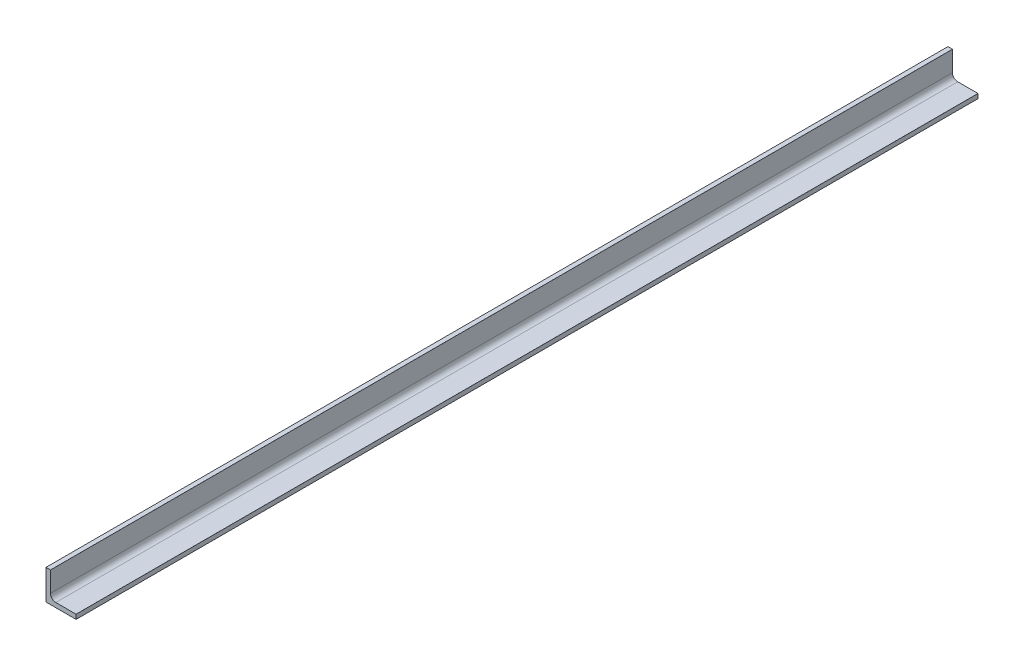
ISO-10303-21;
HEADER;
FILE_DESCRIPTION(('STEP AP214'),'2;1');
FILE_NAME('part.step','',(''),(''),'','','');
FILE_SCHEMA(('AUTOMOTIVE_DESIGN { 1 0 10303 214 1 1 1 1 }'));
ENDSEC;
DATA;
#1=APPLICATION_CONTEXT('core data for automotive mechanical design processes');
#2=APPLICATION_PROTOCOL_DEFINITION('international standard','automotive_design',2000,#1);
#3=PRODUCT_CONTEXT('',#1,'mechanical');
#4=PRODUCT('Part','Part','',(#3));
#5=PRODUCT_RELATED_PRODUCT_CATEGORY('part','',(#4));
#6=PRODUCT_DEFINITION_FORMATION('','',#4);
#7=PRODUCT_DEFINITION_CONTEXT('part definition',#1,'design');
#8=PRODUCT_DEFINITION('design','',#6,#7);
#9=PRODUCT_DEFINITION_SHAPE('','',#8);
#10=(LENGTH_UNIT() NAMED_UNIT(*) SI_UNIT(.MILLI.,.METRE.));
#11=(NAMED_UNIT(*) PLANE_ANGLE_UNIT() SI_UNIT($,.RADIAN.));
#12=(NAMED_UNIT(*) SI_UNIT($,.STERADIAN.) SOLID_ANGLE_UNIT());
#13=UNCERTAINTY_MEASURE_WITH_UNIT(LENGTH_MEASURE(1.E-05),#10,'distance_accuracy_value','');
#14=(GEOMETRIC_REPRESENTATION_CONTEXT(3) GLOBAL_UNCERTAINTY_ASSIGNED_CONTEXT((#13)) GLOBAL_UNIT_ASSIGNED_CONTEXT((#10,
#11,#12)) REPRESENTATION_CONTEXT('',''));
#15=CARTESIAN_POINT('',(0.,0.,0.));
#16=DIRECTION('',(0.,0.,1.));
#17=DIRECTION('',(1.,0.,0.));
#18=AXIS2_PLACEMENT_3D('',#15,#16,#17);
#19=CARTESIAN_POINT('',(20.,0.,600.));
#20=DIRECTION('',(0.,1.,0.));
#21=DIRECTION('',(-1.,0.,0.));
#22=AXIS2_PLACEMENT_3D('',#19,#20,#21);
#23=PLANE('',#22);
#24=DIRECTION('',(1.,0.,0.));
#25=VECTOR('',#24,1.);
#26=CARTESIAN_POINT('',(20.,0.,0.));
#27=LINE('',#26,#25);
#28=CARTESIAN_POINT('',(0.,0.,0.));
#29=VERTEX_POINT('',#28);
#30=CARTESIAN_POINT('',(20.,0.,0.));
#31=VERTEX_POINT('',#30);
#32=EDGE_CURVE('E134',#29,#31,#27,.T.);
#33=ORIENTED_EDGE('',*,*,#32,.T.);
#34=DIRECTION('',(0.,0.,-1.));
#35=VECTOR('',#34,1.);
#36=CARTESIAN_POINT('',(20.,0.,600.));
#37=LINE('',#36,#35);
#38=CARTESIAN_POINT('',(20.,0.,600.));
#39=VERTEX_POINT('',#38);
#40=EDGE_CURVE('E11',#39,#31,#37,.T.);
#41=ORIENTED_EDGE('',*,*,#40,.F.);
#42=DIRECTION('',(1.,0.,0.));
#43=VECTOR('',#42,1.);
#44=CARTESIAN_POINT('',(20.,0.,600.));
#45=LINE('',#44,#43);
#46=CARTESIAN_POINT('',(0.,0.,600.));
#47=VERTEX_POINT('',#46);
#48=EDGE_CURVE('E150',#47,#39,#45,.T.);
#49=ORIENTED_EDGE('',*,*,#48,.F.);
#50=DIRECTION('',(0.,0.,-1.));
#51=VECTOR('',#50,1.);
#52=CARTESIAN_POINT('',(0.,0.,600.));
#53=LINE('',#52,#51);
#54=EDGE_CURVE('E130',#47,#29,#53,.T.);
#55=ORIENTED_EDGE('',*,*,#54,.T.);
#56=EDGE_LOOP('',(#33,#41,#49,#55));
#57=FACE_BOUND('',#56,.T.);
#58=ADVANCED_FACE('F32',(#57),#23,.F.);
#59=CARTESIAN_POINT('',(20.,2.99,600.));
#60=DIRECTION('',(-1.,0.,0.));
#61=DIRECTION('',(0.,-1.,0.));
#62=AXIS2_PLACEMENT_3D('',#59,#60,#61);
#63=PLANE('',#62);
#64=DIRECTION('',(0.,1.,0.));
#65=VECTOR('',#64,1.);
#66=CARTESIAN_POINT('',(20.,2.99,0.));
#67=LINE('',#66,#65);
#68=CARTESIAN_POINT('',(20.,2.99,0.));
#69=VERTEX_POINT('',#68);
#70=EDGE_CURVE('E137',#31,#69,#67,.T.);
#71=ORIENTED_EDGE('',*,*,#70,.T.);
#72=DIRECTION('',(0.,0.,-1.));
#73=VECTOR('',#72,1.);
#74=CARTESIAN_POINT('',(20.,2.99,600.));
#75=LINE('',#74,#73);
#76=CARTESIAN_POINT('',(20.,2.99,600.));
#77=VERTEX_POINT('',#76);
#78=EDGE_CURVE('E40',#77,#69,#75,.T.);
#79=ORIENTED_EDGE('',*,*,#78,.F.);
#80=DIRECTION('',(0.,1.,0.));
#81=VECTOR('',#80,1.);
#82=CARTESIAN_POINT('',(20.,2.99,600.));
#83=LINE('',#82,#81);
#84=EDGE_CURVE('E94',#39,#77,#83,.T.);
#85=ORIENTED_EDGE('',*,*,#84,.F.);
#86=ORIENTED_EDGE('',*,*,#40,.T.);
#87=EDGE_LOOP('',(#71,#79,#85,#86));
#88=FACE_BOUND('',#87,.T.);
#89=ADVANCED_FACE('F193',(#88),#63,.F.);
#90=CARTESIAN_POINT('',(19.99,2.99,600.));
#91=DIRECTION('',(0.,0.,-1.));
#92=DIRECTION('',(-1.,0.,0.));
#93=AXIS2_PLACEMENT_3D('',#90,#91,#92);
#94=CYLINDRICAL_SURFACE('',#93,0.00999999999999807);
#95=CARTESIAN_POINT('',(19.99,2.99,0.));
#96=DIRECTION('',(0.,0.,1.));
#97=DIRECTION('',(1.,0.,0.));
#98=AXIS2_PLACEMENT_3D('',#95,#96,#97);
#99=CIRCLE('',#98,0.00999999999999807);
#100=CARTESIAN_POINT('',(19.99,3.,0.));
#101=VERTEX_POINT('',#100);
#102=EDGE_CURVE('E139',#69,#101,#99,.T.);
#103=ORIENTED_EDGE('',*,*,#102,.T.);
#104=DIRECTION('',(0.,0.,-1.));
#105=VECTOR('',#104,1.);
#106=CARTESIAN_POINT('',(19.99,3.,600.));
#107=LINE('',#106,#105);
#108=CARTESIAN_POINT('',(19.99,3.,600.));
#109=VERTEX_POINT('',#108);
#110=EDGE_CURVE('E160',#109,#101,#107,.T.);
#111=ORIENTED_EDGE('',*,*,#110,.F.);
#112=CARTESIAN_POINT('',(19.99,2.99,600.));
#113=DIRECTION('',(0.,0.,1.));
#114=DIRECTION('',(1.,0.,0.));
#115=AXIS2_PLACEMENT_3D('',#112,#113,#114);
#116=CIRCLE('',#115,0.00999999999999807);
#117=EDGE_CURVE('E168',#77,#109,#116,.T.);
#118=ORIENTED_EDGE('',*,*,#117,.F.);
#119=ORIENTED_EDGE('',*,*,#78,.T.);
#120=EDGE_LOOP('',(#103,#111,#118,#119));
#121=FACE_BOUND('',#120,.T.);
#122=ADVANCED_FACE('F166',(#121),#94,.T.);
#123=CARTESIAN_POINT('',(6.5,3.,600.));
#124=DIRECTION('',(0.,-1.,0.));
#125=DIRECTION('',(1.,0.,0.));
#126=AXIS2_PLACEMENT_3D('',#123,#124,#125);
#127=PLANE('',#126);
#128=DIRECTION('',(-1.,0.,0.));
#129=VECTOR('',#128,1.);
#130=CARTESIAN_POINT('',(6.5,3.,0.));
#131=LINE('',#130,#129);
#132=CARTESIAN_POINT('',(6.5,3.,0.));
#133=VERTEX_POINT('',#132);
#134=EDGE_CURVE('E141',#101,#133,#131,.T.);
#135=ORIENTED_EDGE('',*,*,#134,.T.);
#136=DIRECTION('',(0.,0.,-1.));
#137=VECTOR('',#136,1.);
#138=CARTESIAN_POINT('',(6.5,3.,600.));
#139=LINE('',#138,#137);
#140=CARTESIAN_POINT('',(6.5,3.,600.));
#141=VERTEX_POINT('',#140);
#142=EDGE_CURVE('E157',#141,#133,#139,.T.);
#143=ORIENTED_EDGE('',*,*,#142,.F.);
#144=DIRECTION('',(-1.,0.,0.));
#145=VECTOR('',#144,1.);
#146=CARTESIAN_POINT('',(6.5,3.,600.));
#147=LINE('',#146,#145);
#148=EDGE_CURVE('E184',#109,#141,#147,.T.);
#149=ORIENTED_EDGE('',*,*,#148,.F.);
#150=ORIENTED_EDGE('',*,*,#110,.T.);
#151=EDGE_LOOP('',(#135,#143,#149,#150));
#152=FACE_BOUND('',#151,.T.);
#153=ADVANCED_FACE('F177',(#152),#127,.F.);
#154=CARTESIAN_POINT('',(6.5,6.5,600.));
#155=DIRECTION('',(0.,0.,-1.));
#156=DIRECTION('',(-1.,0.,0.));
#157=AXIS2_PLACEMENT_3D('',#154,#155,#156);
#158=CYLINDRICAL_SURFACE('',#157,3.5);
#159=CARTESIAN_POINT('',(6.5,6.5,0.));
#160=DIRECTION('',(0.,0.,-1.));
#161=DIRECTION('',(-1.,0.,0.));
#162=AXIS2_PLACEMENT_3D('',#159,#160,#161);
#163=CIRCLE('',#162,3.5);
#164=CARTESIAN_POINT('',(3.,6.5,0.));
#165=VERTEX_POINT('',#164);
#166=EDGE_CURVE('E143',#133,#165,#163,.T.);
#167=ORIENTED_EDGE('',*,*,#166,.T.);
#168=DIRECTION('',(0.,0.,-1.));
#169=VECTOR('',#168,1.);
#170=CARTESIAN_POINT('',(3.,6.5,600.));
#171=LINE('',#170,#169);
#172=CARTESIAN_POINT('',(3.,6.5,600.));
#173=VERTEX_POINT('',#172);
#174=EDGE_CURVE('E154',#173,#165,#171,.T.);
#175=ORIENTED_EDGE('',*,*,#174,.F.);
#176=CARTESIAN_POINT('',(6.5,6.5,600.));
#177=DIRECTION('',(0.,0.,-1.));
#178=DIRECTION('',(-1.,0.,0.));
#179=AXIS2_PLACEMENT_3D('',#176,#177,#178);
#180=CIRCLE('',#179,3.5);
#181=EDGE_CURVE('E183',#141,#173,#180,.T.);
#182=ORIENTED_EDGE('',*,*,#181,.F.);
#183=ORIENTED_EDGE('',*,*,#142,.T.);
#184=EDGE_LOOP('',(#167,#175,#182,#183));
#185=FACE_BOUND('',#184,.T.);
#186=ADVANCED_FACE('F181',(#185),#158,.F.);
#187=CARTESIAN_POINT('',(3.,19.99,600.));
#188=DIRECTION('',(-1.,0.,0.));
#189=DIRECTION('',(0.,-1.,0.));
#190=AXIS2_PLACEMENT_3D('',#187,#188,#189);
#191=PLANE('',#190);
#192=DIRECTION('',(0.,1.,0.));
#193=VECTOR('',#192,1.);
#194=CARTESIAN_POINT('',(3.,19.99,0.));
#195=LINE('',#194,#193);
#196=CARTESIAN_POINT('',(3.,19.99,0.));
#197=VERTEX_POINT('',#196);
#198=EDGE_CURVE('E145',#165,#197,#195,.T.);
#199=ORIENTED_EDGE('',*,*,#198,.T.);
#200=DIRECTION('',(0.,0.,-1.));
#201=VECTOR('',#200,1.);
#202=CARTESIAN_POINT('',(3.,19.99,600.));
#203=LINE('',#202,#201);
#204=CARTESIAN_POINT('',(3.,19.99,600.));
#205=VERTEX_POINT('',#204);
#206=EDGE_CURVE('E125',#205,#197,#203,.T.);
#207=ORIENTED_EDGE('',*,*,#206,.F.);
#208=DIRECTION('',(0.,1.,0.));
#209=VECTOR('',#208,1.);
#210=CARTESIAN_POINT('',(3.,19.99,600.));
#211=LINE('',#210,#209);
#212=EDGE_CURVE('E116',#173,#205,#211,.T.);
#213=ORIENTED_EDGE('',*,*,#212,.F.);
#214=ORIENTED_EDGE('',*,*,#174,.T.);
#215=EDGE_LOOP('',(#199,#207,#213,#214));
#216=FACE_BOUND('',#215,.T.);
#217=ADVANCED_FACE('F205',(#216),#191,.F.);
#218=CARTESIAN_POINT('',(2.99,19.99,600.));
#219=DIRECTION('',(0.,0.,-1.));
#220=DIRECTION('',(-1.,0.,0.));
#221=AXIS2_PLACEMENT_3D('',#218,#219,#220);
#222=CYLINDRICAL_SURFACE('',#221,0.0100000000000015);
#223=CARTESIAN_POINT('',(2.99,19.99,0.));
#224=DIRECTION('',(0.,0.,1.));
#225=DIRECTION('',(1.,0.,0.));
#226=AXIS2_PLACEMENT_3D('',#223,#224,#225);
#227=CIRCLE('',#226,0.0100000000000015);
#228=CARTESIAN_POINT('',(2.99,20.,0.));
#229=VERTEX_POINT('',#228);
#230=EDGE_CURVE('E124',#197,#229,#227,.T.);
#231=ORIENTED_EDGE('',*,*,#230,.T.);
#232=DIRECTION('',(0.,0.,-1.));
#233=VECTOR('',#232,1.);
#234=CARTESIAN_POINT('',(2.99,20.,600.));
#235=LINE('',#234,#233);
#236=CARTESIAN_POINT('',(2.99,20.,600.));
#237=VERTEX_POINT('',#236);
#238=EDGE_CURVE('E121',#237,#229,#235,.T.);
#239=ORIENTED_EDGE('',*,*,#238,.F.);
#240=CARTESIAN_POINT('',(2.99,19.99,600.));
#241=DIRECTION('',(0.,0.,1.));
#242=DIRECTION('',(1.,0.,0.));
#243=AXIS2_PLACEMENT_3D('',#240,#241,#242);
#244=CIRCLE('',#243,0.0100000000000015);
#245=EDGE_CURVE('E110',#205,#237,#244,.T.);
#246=ORIENTED_EDGE('',*,*,#245,.F.);
#247=ORIENTED_EDGE('',*,*,#206,.T.);
#248=EDGE_LOOP('',(#231,#239,#246,#247));
#249=FACE_BOUND('',#248,.T.);
#250=ADVANCED_FACE('F122',(#249),#222,.T.);
#251=CARTESIAN_POINT('',(0.,20.,600.));
#252=DIRECTION('',(0.,-1.,0.));
#253=DIRECTION('',(1.,0.,0.));
#254=AXIS2_PLACEMENT_3D('',#251,#252,#253);
#255=PLANE('',#254);
#256=DIRECTION('',(-1.,0.,0.));
#257=VECTOR('',#256,1.);
#258=CARTESIAN_POINT('',(0.,20.,0.));
#259=LINE('',#258,#257);
#260=CARTESIAN_POINT('',(0.,20.,0.));
#261=VERTEX_POINT('',#260);
#262=EDGE_CURVE('E80',#229,#261,#259,.T.);
#263=ORIENTED_EDGE('',*,*,#262,.T.);
#264=DIRECTION('',(0.,0.,-1.));
#265=VECTOR('',#264,1.);
#266=CARTESIAN_POINT('',(0.,20.,600.));
#267=LINE('',#266,#265);
#268=CARTESIAN_POINT('',(0.,20.,600.));
#269=VERTEX_POINT('',#268);
#270=EDGE_CURVE('E126',#269,#261,#267,.T.);
#271=ORIENTED_EDGE('',*,*,#270,.F.);
#272=DIRECTION('',(-1.,0.,0.));
#273=VECTOR('',#272,1.);
#274=CARTESIAN_POINT('',(0.,20.,600.));
#275=LINE('',#274,#273);
#276=EDGE_CURVE('E114',#237,#269,#275,.T.);
#277=ORIENTED_EDGE('',*,*,#276,.F.);
#278=ORIENTED_EDGE('',*,*,#238,.T.);
#279=EDGE_LOOP('',(#263,#271,#277,#278));
#280=FACE_BOUND('',#279,.T.);
#281=ADVANCED_FACE('F128',(#280),#255,.F.);
#282=CARTESIAN_POINT('',(0.,0.,600.));
#283=DIRECTION('',(1.,0.,0.));
#284=DIRECTION('',(0.,0.,-1.));
#285=AXIS2_PLACEMENT_3D('',#282,#283,#284);
#286=PLANE('',#285);
#287=DIRECTION('',(0.,-1.,0.));
#288=VECTOR('',#287,1.);
#289=CARTESIAN_POINT('',(0.,0.,0.));
#290=LINE('',#289,#288);
#291=EDGE_CURVE('E86',#261,#29,#290,.T.);
#292=ORIENTED_EDGE('',*,*,#291,.T.);
#293=ORIENTED_EDGE('',*,*,#54,.F.);
#294=DIRECTION('',(0.,-1.,0.));
#295=VECTOR('',#294,1.);
#296=CARTESIAN_POINT('',(0.,0.,600.));
#297=LINE('',#296,#295);
#298=EDGE_CURVE('E48',#269,#47,#297,.T.);
#299=ORIENTED_EDGE('',*,*,#298,.F.);
#300=ORIENTED_EDGE('',*,*,#270,.T.);
#301=EDGE_LOOP('',(#292,#293,#299,#300));
#302=FACE_BOUND('',#301,.T.);
#303=ADVANCED_FACE('F213',(#302),#286,.F.);
#304=CARTESIAN_POINT('',(2.99,19.99,600.));
#305=DIRECTION('',(0.,0.,1.));
#306=DIRECTION('',(1.,0.,0.));
#307=AXIS2_PLACEMENT_3D('',#304,#305,#306);
#308=PLANE('',#307);
#309=ORIENTED_EDGE('',*,*,#48,.T.);
#310=ORIENTED_EDGE('',*,*,#84,.T.);
#311=ORIENTED_EDGE('',*,*,#117,.T.);
#312=ORIENTED_EDGE('',*,*,#148,.T.);
#313=ORIENTED_EDGE('',*,*,#181,.T.);
#314=ORIENTED_EDGE('',*,*,#212,.T.);
#315=ORIENTED_EDGE('',*,*,#245,.T.);
#316=ORIENTED_EDGE('',*,*,#276,.T.);
#317=ORIENTED_EDGE('',*,*,#298,.T.);
#318=EDGE_LOOP('',(#309,#310,#311,#312,#313,#314,#315,#316,#317));
#319=FACE_BOUND('',#318,.T.);
#320=ADVANCED_FACE('F112',(#319),#308,.T.);
#321=CARTESIAN_POINT('',(2.99,19.99,0.));
#322=DIRECTION('',(0.,0.,1.));
#323=DIRECTION('',(1.,0.,0.));
#324=AXIS2_PLACEMENT_3D('',#321,#322,#323);
#325=PLANE('',#324);
#326=ORIENTED_EDGE('',*,*,#32,.F.);
#327=ORIENTED_EDGE('',*,*,#291,.F.);
#328=ORIENTED_EDGE('',*,*,#262,.F.);
#329=ORIENTED_EDGE('',*,*,#230,.F.);
#330=ORIENTED_EDGE('',*,*,#198,.F.);
#331=ORIENTED_EDGE('',*,*,#166,.F.);
#332=ORIENTED_EDGE('',*,*,#134,.F.);
#333=ORIENTED_EDGE('',*,*,#102,.F.);
#334=ORIENTED_EDGE('',*,*,#70,.F.);
#335=EDGE_LOOP('',(#326,#327,#328,#329,#330,#331,#332,#333,#334));
#336=FACE_BOUND('',#335,.T.);
#337=ADVANCED_FACE('F172',(#336),#325,.F.);
#338=CLOSED_SHELL('',(#58,#89,#122,#153,#186,#217,#250,#281,#303,#320,#337));
#339=MANIFOLD_SOLID_BREP('B2',#338);
#340=ADVANCED_BREP_SHAPE_REPRESENTATION('',(#18,#339),#14);
#341=SHAPE_DEFINITION_REPRESENTATION(#9,#340);
ENDSEC;
END-ISO-10303-21;
